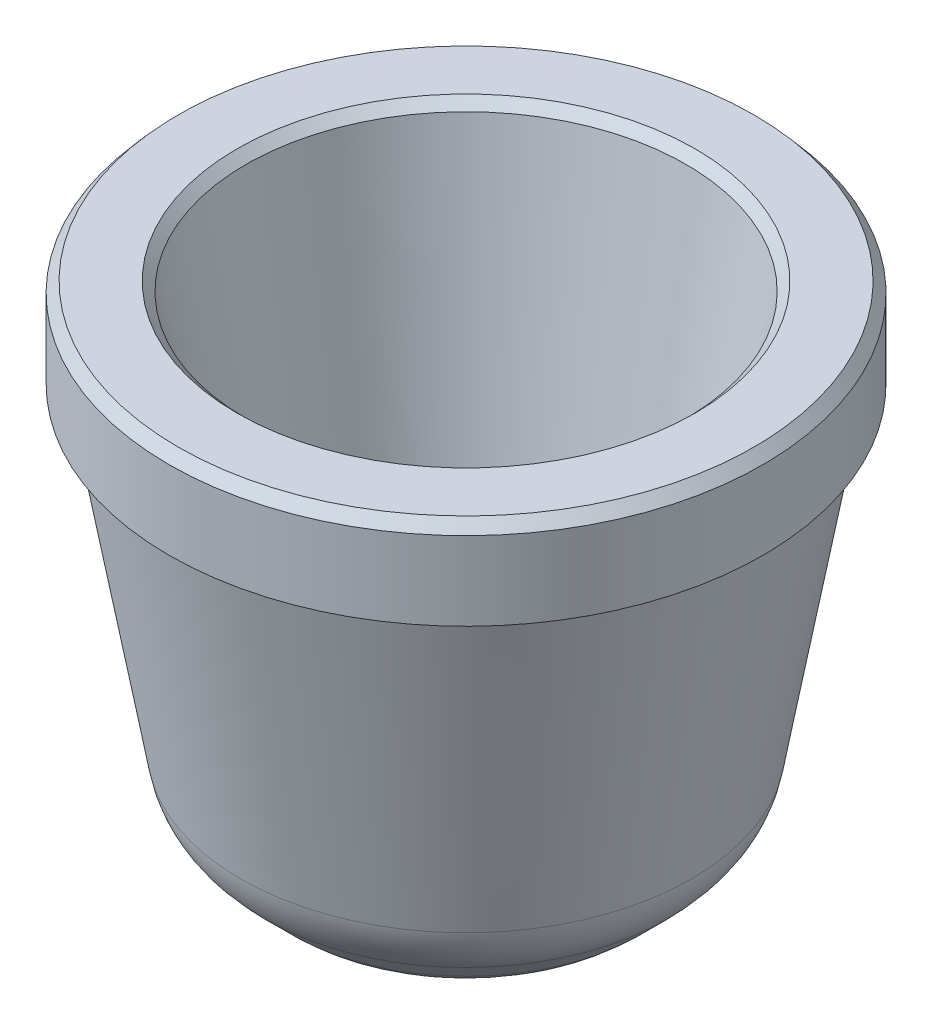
ISO-10303-21;
HEADER;
FILE_DESCRIPTION(('STEP AP214'),'2;1');
FILE_NAME('part.step','',(''),(''),'','','');
FILE_SCHEMA(('AUTOMOTIVE_DESIGN { 1 0 10303 214 1 1 1 1 }'));
ENDSEC;
DATA;
#1=APPLICATION_CONTEXT('core data for automotive mechanical design processes');
#2=APPLICATION_PROTOCOL_DEFINITION('international standard','automotive_design',2000,#1);
#3=PRODUCT_CONTEXT('',#1,'mechanical');
#4=PRODUCT('Part','Part','',(#3));
#5=PRODUCT_RELATED_PRODUCT_CATEGORY('part','',(#4));
#6=PRODUCT_DEFINITION_FORMATION('','',#4);
#7=PRODUCT_DEFINITION_CONTEXT('part definition',#1,'design');
#8=PRODUCT_DEFINITION('design','',#6,#7);
#9=PRODUCT_DEFINITION_SHAPE('','',#8);
#10=(LENGTH_UNIT() NAMED_UNIT(*) SI_UNIT(.MILLI.,.METRE.));
#11=(NAMED_UNIT(*) PLANE_ANGLE_UNIT() SI_UNIT($,.RADIAN.));
#12=(NAMED_UNIT(*) SI_UNIT($,.STERADIAN.) SOLID_ANGLE_UNIT());
#13=UNCERTAINTY_MEASURE_WITH_UNIT(LENGTH_MEASURE(1.E-05),#10,'distance_accuracy_value','');
#14=(GEOMETRIC_REPRESENTATION_CONTEXT(3) GLOBAL_UNCERTAINTY_ASSIGNED_CONTEXT((#13)) GLOBAL_UNIT_ASSIGNED_CONTEXT((#10,
#11,#12)) REPRESENTATION_CONTEXT('',''));
#15=CARTESIAN_POINT('',(0.,0.,0.));
#16=DIRECTION('',(0.,0.,1.));
#17=DIRECTION('',(1.,0.,0.));
#18=AXIS2_PLACEMENT_3D('',#15,#16,#17);
#19=CARTESIAN_POINT('',(0.,0.,0.));
#20=DIRECTION('',(0.,1.,0.));
#21=DIRECTION('',(0.,0.,1.));
#22=AXIS2_PLACEMENT_3D('',#19,#20,#21);
#23=PLANE('',#22);
#24=CARTESIAN_POINT('',(0.,0.,0.));
#25=DIRECTION('',(0.,1.,0.));
#26=DIRECTION('',(0.,0.,1.));
#27=AXIS2_PLACEMENT_3D('',#24,#25,#26);
#28=CIRCLE('',#27,4.92343401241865);
#29=CARTESIAN_POINT('',(0.,0.,4.92343401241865));
#30=VERTEX_POINT('',#29);
#31=EDGE_CURVE('E36',#30,#30,#28,.T.);
#32=ORIENTED_EDGE('',*,*,#31,.T.);
#33=EDGE_LOOP('',(#32));
#34=FACE_BOUND('',#33,.T.);
#35=CARTESIAN_POINT('',(0.,0.,0.));
#36=DIRECTION('',(0.,1.,0.));
#37=DIRECTION('',(0.,0.,1.));
#38=AXIS2_PLACEMENT_3D('',#35,#36,#37);
#39=CIRCLE('',#38,3.91740820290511);
#40=CARTESIAN_POINT('',(0.,0.,3.91740820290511));
#41=VERTEX_POINT('',#40);
#42=EDGE_CURVE('E40',#41,#41,#39,.F.);
#43=ORIENTED_EDGE('',*,*,#42,.T.);
#44=EDGE_LOOP('',(#43));
#45=FACE_BOUND('',#44,.T.);
#46=ADVANCED_FACE('F26',(#34,#45),#23,.T.);
#47=CARTESIAN_POINT('',(0.,0.220533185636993,0.));
#48=DIRECTION('',(0.,1.,0.));
#49=DIRECTION('',(0.,0.,1.));
#50=AXIS2_PLACEMENT_3D('',#47,#48,#49);
#51=CONICAL_SURFACE('',#50,3.8292941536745,0.174532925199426);
#52=CARTESIAN_POINT('',(0.,-0.154187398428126,0.));
#53=DIRECTION('',(0.,1.,0.));
#54=DIRECTION('',(0.,0.,1.));
#55=AXIS2_PLACEMENT_3D('',#52,#53,#54);
#56=CIRCLE('',#55,3.76322080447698);
#57=CARTESIAN_POINT('',(0.,-0.154187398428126,3.76322080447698));
#58=VERTEX_POINT('',#57);
#59=EDGE_CURVE('E10',#58,#58,#56,.T.);
#60=ORIENTED_EDGE('',*,*,#59,.T.);
#61=EDGE_LOOP('',(#60));
#62=FACE_BOUND('',#61,.T.);
#63=CARTESIAN_POINT('',(0.,-6.70724669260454,0.));
#64=DIRECTION('',(0.,1.,0.));
#65=DIRECTION('',(0.,0.,1.));
#66=AXIS2_PLACEMENT_3D('',#63,#64,#65);
#67=CIRCLE('',#66,2.60773964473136);
#68=CARTESIAN_POINT('',(0.,-6.70724669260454,2.60773964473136));
#69=VERTEX_POINT('',#68);
#70=EDGE_CURVE('E49',#69,#69,#67,.T.);
#71=ORIENTED_EDGE('',*,*,#70,.F.);
#72=EDGE_LOOP('',(#71));
#73=FACE_BOUND('',#72,.T.);
#74=ADVANCED_FACE('F97',(#62,#73),#51,.F.);
#75=CARTESIAN_POINT('',(0.,-6.50296951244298,0.));
#76=DIRECTION('',(0.,1.,0.));
#77=DIRECTION('',(0.,0.,1.));
#78=AXIS2_PLACEMENT_3D('',#75,#76,#77);
#79=CONICAL_SURFACE('',#78,2.87697926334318,0.785398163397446);
#80=CARTESIAN_POINT('',(0.,-6.84274517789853,0.));
#81=DIRECTION('',(0.,1.,0.));
#82=DIRECTION('',(0.,0.,1.));
#83=AXIS2_PLACEMENT_3D('',#80,#81,#82);
#84=CIRCLE('',#83,2.53720359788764);
#85=CARTESIAN_POINT('',(0.,-6.84274517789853,2.53720359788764));
#86=VERTEX_POINT('',#85);
#87=EDGE_CURVE('E65',#86,#86,#84,.F.);
#88=ORIENTED_EDGE('',*,*,#87,.F.);
#89=EDGE_LOOP('',(#88));
#90=FACE_BOUND('',#89,.T.);
#91=CARTESIAN_POINT('',(0.,-7.29160512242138,0.));
#92=DIRECTION('',(0.,1.,0.));
#93=DIRECTION('',(0.,0.,1.));
#94=AXIS2_PLACEMENT_3D('',#91,#92,#93);
#95=CIRCLE('',#94,2.08834365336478);
#96=CARTESIAN_POINT('',(0.,-7.29160512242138,2.08834365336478));
#97=VERTEX_POINT('',#96);
#98=EDGE_CURVE('E66',#97,#97,#95,.T.);
#99=ORIENTED_EDGE('',*,*,#98,.F.);
#100=EDGE_LOOP('',(#99));
#101=FACE_BOUND('',#100,.T.);
#102=ADVANCED_FACE('F102',(#90,#101),#79,.F.);
#103=CARTESIAN_POINT('',(2.54,-7.366,0.));
#104=DIRECTION('',(0.,-1.,0.));
#105=DIRECTION('',(0.,0.,-1.));
#106=AXIS2_PLACEMENT_3D('',#103,#104,#105);
#107=PLANE('',#106);
#108=CARTESIAN_POINT('',(0.,-7.366,0.));
#109=DIRECTION('',(0.,-1.,0.));
#110=DIRECTION('',(0.,0.,-1.));
#111=AXIS2_PLACEMENT_3D('',#108,#109,#110);
#112=CIRCLE('',#111,1.9087385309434);
#113=CARTESIAN_POINT('',(0.,-7.366,-1.9087385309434));
#114=VERTEX_POINT('',#113);
#115=EDGE_CURVE('E62',#114,#114,#112,.T.);
#116=ORIENTED_EDGE('',*,*,#115,.F.);
#117=EDGE_LOOP('',(#116));
#118=FACE_BOUND('',#117,.T.);
#119=ADVANCED_FACE('F142',(#118),#107,.F.);
#120=CARTESIAN_POINT('',(0.,-6.66314005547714,0.));
#121=DIRECTION('',(0.,-1.,0.));
#122=DIRECTION('',(0.,0.,-1.));
#123=AXIS2_PLACEMENT_3D('',#120,#121,#122);
#124=TOROIDAL_SURFACE('',#123,2.35759847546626,0.254);
#125=ORIENTED_EDGE('',*,*,#87,.T.);
#126=EDGE_LOOP('',(#125));
#127=FACE_BOUND('',#126,.T.);
#128=ORIENTED_EDGE('',*,*,#70,.T.);
#129=EDGE_LOOP('',(#128));
#130=FACE_BOUND('',#129,.T.);
#131=ADVANCED_FACE('F138',(#127,#130),#124,.F.);
#132=CARTESIAN_POINT('',(0.,-7.112,0.));
#133=DIRECTION('',(0.,-1.,0.));
#134=DIRECTION('',(0.,0.,-1.));
#135=AXIS2_PLACEMENT_3D('',#132,#133,#134);
#136=TOROIDAL_SURFACE('',#135,1.9087385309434,0.254);
#137=ORIENTED_EDGE('',*,*,#115,.T.);
#138=EDGE_LOOP('',(#137));
#139=FACE_BOUND('',#138,.T.);
#140=ORIENTED_EDGE('',*,*,#98,.T.);
#141=EDGE_LOOP('',(#140));
#142=FACE_BOUND('',#141,.T.);
#143=ADVANCED_FACE('F92',(#139,#142),#136,.F.);
#144=CARTESIAN_POINT('',(0.,-1.524,0.));
#145=DIRECTION('',(0.,1.,0.));
#146=DIRECTION('',(0.,0.,1.));
#147=AXIS2_PLACEMENT_3D('',#144,#145,#146);
#148=CYLINDRICAL_SURFACE('',#147,5.08);
#149=CARTESIAN_POINT('',(0.,-0.181374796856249,0.));
#150=DIRECTION('',(0.,1.,0.));
#151=DIRECTION('',(0.,0.,1.));
#152=AXIS2_PLACEMENT_3D('',#149,#150,#151);
#153=CIRCLE('',#152,5.08);
#154=CARTESIAN_POINT('',(0.,-0.181374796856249,5.08));
#155=VERTEX_POINT('',#154);
#156=EDGE_CURVE('E32',#155,#155,#153,.F.);
#157=CARTESIAN_POINT('',(0.,-1.524,0.));
#158=DIRECTION('',(0.,1.,0.));
#159=DIRECTION('',(0.,0.,1.));
#160=AXIS2_PLACEMENT_3D('',#157,#158,#159);
#161=CIRCLE('',#160,5.08);
#162=CARTESIAN_POINT('',(0.,-1.524,5.08));
#163=VERTEX_POINT('',#162);
#164=EDGE_CURVE('E50',#163,#163,#161,.T.);
#165=CARTESIAN_POINT('',(0.,-0.181374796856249,5.08));
#166=CARTESIAN_POINT('',(0.,-0.195360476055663,5.08));
#167=CARTESIAN_POINT('',(0.,-0.209346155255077,5.08));
#168=CARTESIAN_POINT('',(0.,-0.237317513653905,5.08));
#169=CARTESIAN_POINT('',(0.,-0.25130319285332,5.08));
#170=CARTESIAN_POINT('',(0.,-0.279274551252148,5.08));
#171=CARTESIAN_POINT('',(0.,-0.293260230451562,5.08));
#172=CARTESIAN_POINT('',(0.,-0.32123158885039,5.08));
#173=CARTESIAN_POINT('',(0.,-0.335217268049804,5.08));
#174=CARTESIAN_POINT('',(0.,-0.363188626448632,5.08));
#175=CARTESIAN_POINT('',(0.,-0.377174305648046,5.08));
#176=CARTESIAN_POINT('',(0.,-0.405145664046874,5.08));
#177=CARTESIAN_POINT('',(0.,-0.419131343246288,5.08));
#178=CARTESIAN_POINT('',(0.,-0.447102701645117,5.08));
#179=CARTESIAN_POINT('',(0.,-0.461088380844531,5.08));
#180=CARTESIAN_POINT('',(0.,-0.489059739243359,5.08));
#181=CARTESIAN_POINT('',(0.,-0.503045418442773,5.08));
#182=CARTESIAN_POINT('',(0.,-0.531016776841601,5.08));
#183=CARTESIAN_POINT('',(0.,-0.545002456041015,5.08));
#184=CARTESIAN_POINT('',(0.,-0.572973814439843,5.08));
#185=CARTESIAN_POINT('',(0.,-0.586959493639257,5.08));
#186=CARTESIAN_POINT('',(0.,-0.614930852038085,5.08));
#187=CARTESIAN_POINT('',(0.,-0.628916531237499,5.08));
#188=CARTESIAN_POINT('',(0.,-0.656887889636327,5.08));
#189=CARTESIAN_POINT('',(0.,-0.670873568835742,5.08));
#190=CARTESIAN_POINT('',(0.,-0.69884492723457,5.08));
#191=CARTESIAN_POINT('',(0.,-0.712830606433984,5.08));
#192=CARTESIAN_POINT('',(0.,-0.740801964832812,5.08));
#193=CARTESIAN_POINT('',(0.,-0.754787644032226,5.08));
#194=CARTESIAN_POINT('',(0.,-0.782759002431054,5.08));
#195=CARTESIAN_POINT('',(0.,-0.796744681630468,5.08));
#196=CARTESIAN_POINT('',(0.,-0.824716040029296,5.08));
#197=CARTESIAN_POINT('',(0.,-0.838701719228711,5.08));
#198=CARTESIAN_POINT('',(0.,-0.866673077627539,5.08));
#199=CARTESIAN_POINT('',(0.,-0.880658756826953,5.08));
#200=CARTESIAN_POINT('',(0.,-0.908630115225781,5.08));
#201=CARTESIAN_POINT('',(0.,-0.922615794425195,5.08));
#202=CARTESIAN_POINT('',(0.,-0.950587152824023,5.08));
#203=CARTESIAN_POINT('',(0.,-0.964572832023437,5.08));
#204=CARTESIAN_POINT('',(0.,-0.992544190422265,5.08));
#205=CARTESIAN_POINT('',(0.,-1.00652986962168,5.08));
#206=CARTESIAN_POINT('',(0.,-1.03450122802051,5.08));
#207=CARTESIAN_POINT('',(0.,-1.04848690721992,5.08));
#208=CARTESIAN_POINT('',(0.,-1.07645826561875,5.08));
#209=CARTESIAN_POINT('',(0.,-1.09044394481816,5.08));
#210=CARTESIAN_POINT('',(0.,-1.11841530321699,5.08));
#211=CARTESIAN_POINT('',(0.,-1.13240098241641,5.08));
#212=CARTESIAN_POINT('',(0.,-1.16037234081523,5.08));
#213=CARTESIAN_POINT('',(0.,-1.17435802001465,5.08));
#214=CARTESIAN_POINT('',(0.,-1.20232937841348,5.08));
#215=CARTESIAN_POINT('',(0.,-1.21631505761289,5.08));
#216=CARTESIAN_POINT('',(0.,-1.24428641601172,5.08));
#217=CARTESIAN_POINT('',(0.,-1.25827209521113,5.08));
#218=CARTESIAN_POINT('',(0.,-1.28624345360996,5.08));
#219=CARTESIAN_POINT('',(0.,-1.30022913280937,5.08));
#220=CARTESIAN_POINT('',(0.,-1.3282004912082,5.08));
#221=CARTESIAN_POINT('',(0.,-1.34218617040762,5.08));
#222=CARTESIAN_POINT('',(0.,-1.37015752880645,5.08));
#223=CARTESIAN_POINT('',(0.,-1.38414320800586,5.08));
#224=CARTESIAN_POINT('',(0.,-1.41211456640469,5.08));
#225=CARTESIAN_POINT('',(0.,-1.4261002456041,5.08));
#226=CARTESIAN_POINT('',(0.,-1.45407160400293,5.08));
#227=CARTESIAN_POINT('',(0.,-1.46805728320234,5.08));
#228=CARTESIAN_POINT('',(0.,-1.49602864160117,5.08));
#229=CARTESIAN_POINT('',(0.,-1.51001432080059,5.08));
#230=CARTESIAN_POINT('',(0.,-1.524,5.08));
#231=B_SPLINE_CURVE_WITH_KNOTS('',3,(#165,#166,#167,#168,#169,#170,#171,#172,#173,#174,#175,
#176,#177,#178,#179,#180,#181,#182,#183,#184,#185,#186,#187,#188,#189,#190,#191,#192,#193,#194,
#195,#196,#197,#198,#199,#200,#201,#202,#203,#204,#205,#206,#207,#208,#209,#210,#211,#212,#213,
#214,#215,#216,#217,#218,#219,#220,#221,#222,#223,#224,#225,#226,#227,#228,#229,#230),
.UNSPECIFIED.,.F.,.F.,(4,2,2,2,2,2,2,2,2,2,2,2,2,2,2,2,2,2,2,2,2,2,2,2,2,2,2,2,2,2,2,2,4),(0.,
0.0419570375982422,0.0839140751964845,0.125871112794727,0.167828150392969,0.209785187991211,
0.251742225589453,0.293699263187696,0.335656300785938,0.37761333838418,0.419570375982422,
0.461527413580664,0.503484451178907,0.545441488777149,0.587398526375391,0.629355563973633,
0.671312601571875,0.713269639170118,0.75522667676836,0.797183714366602,0.839140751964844,
0.881097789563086,0.923054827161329,0.965011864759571,1.00696890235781,1.04892593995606,
1.0908829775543,1.13284001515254,1.17479705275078,1.21675409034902,1.25871112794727,
1.30066816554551,1.34262520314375),.UNSPECIFIED.);
#232=EDGE_CURVE('BSEAM76',#155,#163,#231,.T.);
#233=ORIENTED_EDGE('',*,*,#156,.T.);
#234=ORIENTED_EDGE('',*,*,#164,.T.);
#235=ORIENTED_EDGE('',*,*,#232,.T.);
#236=ORIENTED_EDGE('',*,*,#232,.F.);
#237=EDGE_LOOP('',(#233,#235,#234,#236));
#238=FACE_BOUND('',#237,.T.);
#239=ADVANCED_FACE('F76',(#238),#148,.T.);
#240=CARTESIAN_POINT('',(0.,-1.524,0.));
#241=DIRECTION('',(0.,1.,0.));
#242=DIRECTION('',(0.,0.,1.));
#243=AXIS2_PLACEMENT_3D('',#240,#241,#242);
#244=PLANE('',#243);
#245=CARTESIAN_POINT('',(0.,-1.524,0.));
#246=DIRECTION('',(0.,1.,0.));
#247=DIRECTION('',(0.,0.,1.));
#248=AXIS2_PLACEMENT_3D('',#245,#246,#247);
#249=CIRCLE('',#248,4.81127768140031);
#250=CARTESIAN_POINT('',(0.,-1.524,4.81127768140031));
#251=VERTEX_POINT('',#250);
#252=EDGE_CURVE('E46',#251,#251,#249,.F.);
#253=ORIENTED_EDGE('',*,*,#252,.F.);
#254=EDGE_LOOP('',(#253));
#255=FACE_BOUND('',#254,.T.);
#256=ORIENTED_EDGE('',*,*,#164,.F.);
#257=EDGE_LOOP('',(#256));
#258=FACE_BOUND('',#257,.T.);
#259=ADVANCED_FACE('F78',(#255,#258),#244,.F.);
#260=CARTESIAN_POINT('',(2.54,-8.636,0.));
#261=DIRECTION('',(0.,-1.,0.));
#262=DIRECTION('',(0.,0.,-1.));
#263=AXIS2_PLACEMENT_3D('',#260,#261,#262);
#264=PLANE('',#263);
#265=CARTESIAN_POINT('',(0.,-8.636,0.));
#266=DIRECTION('',(0.,-1.,0.));
#267=DIRECTION('',(0.,0.,-1.));
#268=AXIS2_PLACEMENT_3D('',#265,#266,#267);
#269=CIRCLE('',#268,1.9087385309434);
#270=CARTESIAN_POINT('',(0.,-8.636,-1.9087385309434));
#271=VERTEX_POINT('',#270);
#272=EDGE_CURVE('E45',#271,#271,#269,.T.);
#273=ORIENTED_EDGE('',*,*,#272,.T.);
#274=EDGE_LOOP('',(#273));
#275=FACE_BOUND('',#274,.T.);
#276=ADVANCED_FACE('F80',(#275),#264,.T.);
#277=CARTESIAN_POINT('',(0.,-7.112,0.));
#278=DIRECTION('',(0.,-1.,0.));
#279=DIRECTION('',(0.,0.,-1.));
#280=AXIS2_PLACEMENT_3D('',#277,#278,#279);
#281=TOROIDAL_SURFACE('',#280,1.9087385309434,1.524);
#282=ORIENTED_EDGE('',*,*,#272,.F.);
#283=EDGE_LOOP('',(#282));
#284=FACE_BOUND('',#283,.T.);
#285=CARTESIAN_POINT('',(0.,-8.1896307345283,0.));
#286=DIRECTION('',(0.,-1.,0.));
#287=DIRECTION('',(0.,0.,-1.));
#288=AXIS2_PLACEMENT_3D('',#285,#286,#287);
#289=CIRCLE('',#288,2.9863692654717);
#290=CARTESIAN_POINT('',(0.,-8.1896307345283,-2.9863692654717));
#291=VERTEX_POINT('',#290);
#292=EDGE_CURVE('E56',#291,#291,#289,.F.);
#293=ORIENTED_EDGE('',*,*,#292,.F.);
#294=EDGE_LOOP('',(#293));
#295=FACE_BOUND('',#294,.T.);
#296=ADVANCED_FACE('F88',(#284,#295),#281,.T.);
#297=CARTESIAN_POINT('',(0.,-7.40099512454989,0.));
#298=DIRECTION('',(0.,1.,0.));
#299=DIRECTION('',(0.,0.,1.));
#300=AXIS2_PLACEMENT_3D('',#297,#298,#299);
#301=CONICAL_SURFACE('',#300,3.7750048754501,0.785398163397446);
#302=CARTESIAN_POINT('',(0.,-7.74077079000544,0.));
#303=DIRECTION('',(0.,-1.,0.));
#304=DIRECTION('',(0.,0.,-1.));
#305=AXIS2_PLACEMENT_3D('',#302,#303,#304);
#306=CIRCLE('',#305,3.43522920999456);
#307=CARTESIAN_POINT('',(0.,-7.74077079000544,-3.43522920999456));
#308=VERTEX_POINT('',#307);
#309=EDGE_CURVE('E53',#308,#308,#306,.T.);
#310=ORIENTED_EDGE('',*,*,#309,.T.);
#311=EDGE_LOOP('',(#310));
#312=FACE_BOUND('',#311,.T.);
#313=ORIENTED_EDGE('',*,*,#292,.T.);
#314=EDGE_LOOP('',(#313));
#315=FACE_BOUND('',#314,.T.);
#316=ADVANCED_FACE('F126',(#312,#315),#301,.T.);
#317=CARTESIAN_POINT('',(0.,-6.66314005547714,0.));
#318=DIRECTION('',(0.,-1.,0.));
#319=DIRECTION('',(0.,0.,-1.));
#320=AXIS2_PLACEMENT_3D('',#317,#318,#319);
#321=TOROIDAL_SURFACE('',#320,2.35759847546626,1.524);
#322=ORIENTED_EDGE('',*,*,#309,.F.);
#323=EDGE_LOOP('',(#322));
#324=FACE_BOUND('',#323,.T.);
#325=CARTESIAN_POINT('',(0.,-6.92777987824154,0.));
#326=DIRECTION('',(0.,-1.,0.));
#327=DIRECTION('',(0.,0.,-1.));
#328=AXIS2_PLACEMENT_3D('',#325,#326,#327);
#329=CIRCLE('',#328,3.85844549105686);
#330=CARTESIAN_POINT('',(0.,-6.92777987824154,-3.85844549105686));
#331=VERTEX_POINT('',#330);
#332=EDGE_CURVE('E59',#331,#331,#329,.F.);
#333=ORIENTED_EDGE('',*,*,#332,.F.);
#334=EDGE_LOOP('',(#333));
#335=FACE_BOUND('',#334,.T.);
#336=ADVANCED_FACE('F120',(#324,#335),#321,.T.);
#337=CARTESIAN_POINT('',(0.,0.,0.));
#338=DIRECTION('',(0.,1.,0.));
#339=DIRECTION('',(0.,0.,1.));
#340=AXIS2_PLACEMENT_3D('',#337,#338,#339);
#341=CONICAL_SURFACE('',#340,5.08,0.174532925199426);
#342=ORIENTED_EDGE('',*,*,#332,.T.);
#343=EDGE_LOOP('',(#342));
#344=FACE_BOUND('',#343,.T.);
#345=ORIENTED_EDGE('',*,*,#252,.T.);
#346=EDGE_LOOP('',(#345));
#347=FACE_BOUND('',#346,.T.);
#348=ADVANCED_FACE('F116',(#344,#347),#341,.T.);
#349=CARTESIAN_POINT('',(0.,0.,0.));
#350=DIRECTION('',(0.,-1.,0.));
#351=DIRECTION('',(0.,0.,-1.));
#352=AXIS2_PLACEMENT_3D('',#349,#350,#351);
#353=CONICAL_SURFACE('',#352,4.92343401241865,0.712117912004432);
#354=ORIENTED_EDGE('',*,*,#156,.F.);
#355=EDGE_LOOP('',(#354));
#356=FACE_BOUND('',#355,.T.);
#357=ORIENTED_EDGE('',*,*,#31,.F.);
#358=EDGE_LOOP('',(#357));
#359=FACE_BOUND('',#358,.T.);
#360=ADVANCED_FACE('F111',(#356,#359),#353,.T.);
#361=CARTESIAN_POINT('',(0.,-0.154187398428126,0.));
#362=DIRECTION('',(0.,1.,0.));
#363=DIRECTION('',(0.,0.,1.));
#364=AXIS2_PLACEMENT_3D('',#361,#362,#363);
#365=CONICAL_SURFACE('',#364,3.76322080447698,0.785398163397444);
#366=ORIENTED_EDGE('',*,*,#42,.F.);
#367=EDGE_LOOP('',(#366));
#368=FACE_BOUND('',#367,.T.);
#369=ORIENTED_EDGE('',*,*,#59,.F.);
#370=EDGE_LOOP('',(#369));
#371=FACE_BOUND('',#370,.T.);
#372=ADVANCED_FACE('F108',(#368,#371),#365,.F.);
#373=CLOSED_SHELL('',(#46,#74,#102,#119,#131,#143,#239,#259,#276,#296,#316,#336,#348,#360,#372));
#374=MANIFOLD_SOLID_BREP('B2',#373);
#375=ADVANCED_BREP_SHAPE_REPRESENTATION('',(#18,#374),#14);
#376=SHAPE_DEFINITION_REPRESENTATION(#9,#375);
ENDSEC;
END-ISO-10303-21;
